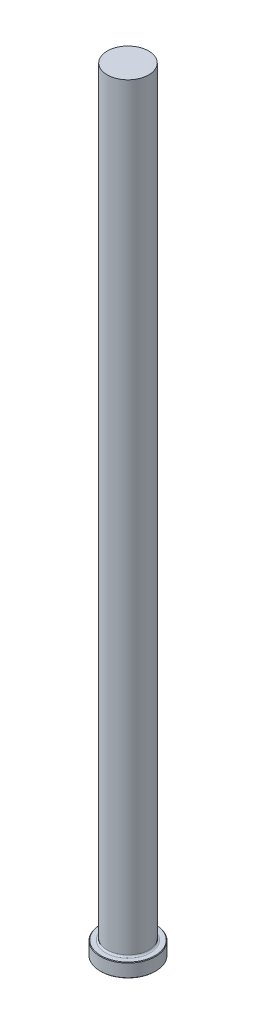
from build123d import *

# Parameters (mm, degrees)
CHAMFER1_SIZE = 0.254
FILLET1_R     = 0.762


with BuildPart() as part:
    # Sketch1 → Revolve1 (revolve)
    with BuildSketch(Plane.XY, mode=Mode.PRIVATE) as revolve1_sk:
        Polygon((0, 0), (-12.7, 0), (-12.7, 6.35), (-9.525, 6.35), (-9.525, 355.6), (0, 355.6), align=None)
    revolve(revolve1_sk.sketch.rotate(Axis((0, 259.958771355, 0), (0, -1, 0)), 270), axis=Axis((0, 259.958771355, 0), (0, -1, 0)))

    # Chamfer1
    chamfer1_edges = [part.edges().sort_by_distance(p)[0] for p in [
        (0, 6.35, -12.7),
        (0, 0, -12.7),
    ]]
    chamfer(chamfer1_edges, length=CHAMFER1_SIZE)

    # Fillet1
    fillet1_edges = [part.edges().sort_by_distance(p)[0] for p in [
        (0, 6.35, -9.525),
    ]]
    fillet(fillet1_edges, radius=FILLET1_R)


solid = part.part
